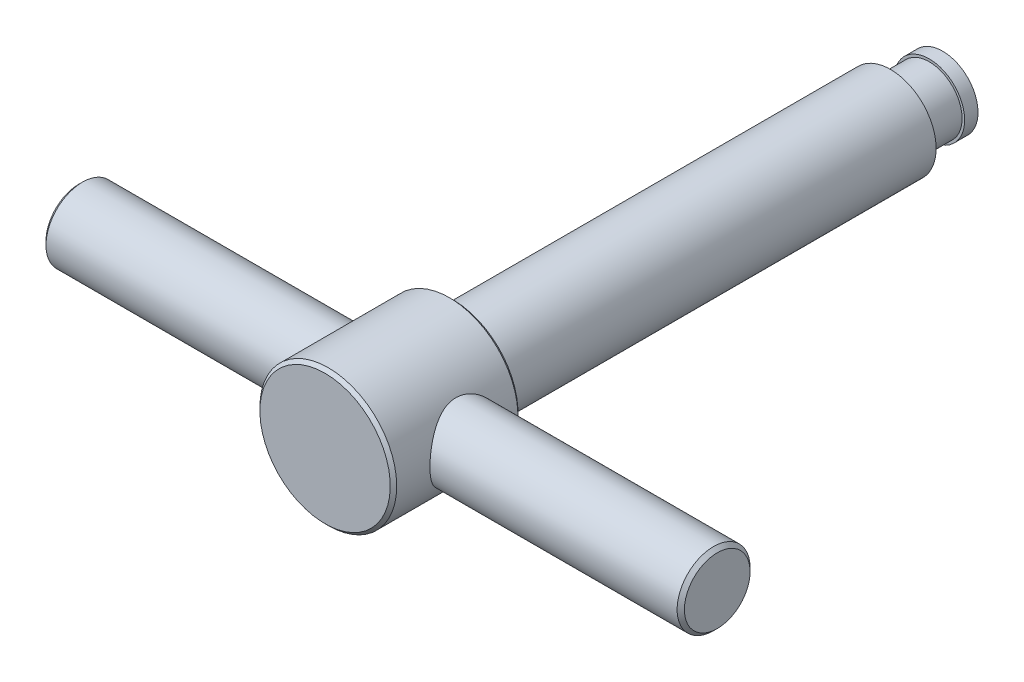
ISO-10303-21;
HEADER;
FILE_DESCRIPTION(('STEP AP214'),'2;1');
FILE_NAME('part.step','',(''),(''),'','','');
FILE_SCHEMA(('AUTOMOTIVE_DESIGN { 1 0 10303 214 1 1 1 1 }'));
ENDSEC;
DATA;
#1=APPLICATION_CONTEXT('core data for automotive mechanical design processes');
#2=APPLICATION_PROTOCOL_DEFINITION('international standard','automotive_design',2000,#1);
#3=PRODUCT_CONTEXT('',#1,'mechanical');
#4=PRODUCT('Part','Part','',(#3));
#5=PRODUCT_RELATED_PRODUCT_CATEGORY('part','',(#4));
#6=PRODUCT_DEFINITION_FORMATION('','',#4);
#7=PRODUCT_DEFINITION_CONTEXT('part definition',#1,'design');
#8=PRODUCT_DEFINITION('design','',#6,#7);
#9=PRODUCT_DEFINITION_SHAPE('','',#8);
#10=(LENGTH_UNIT() NAMED_UNIT(*) SI_UNIT(.MILLI.,.METRE.));
#11=(NAMED_UNIT(*) PLANE_ANGLE_UNIT() SI_UNIT($,.RADIAN.));
#12=(NAMED_UNIT(*) SI_UNIT($,.STERADIAN.) SOLID_ANGLE_UNIT());
#13=UNCERTAINTY_MEASURE_WITH_UNIT(LENGTH_MEASURE(1.E-05),#10,'distance_accuracy_value','');
#14=(GEOMETRIC_REPRESENTATION_CONTEXT(3) GLOBAL_UNCERTAINTY_ASSIGNED_CONTEXT((#13)) GLOBAL_UNIT_ASSIGNED_CONTEXT((#10,
#11,#12)) REPRESENTATION_CONTEXT('',''));
#15=CARTESIAN_POINT('',(0.,0.,0.));
#16=DIRECTION('',(0.,0.,1.));
#17=DIRECTION('',(1.,0.,0.));
#18=AXIS2_PLACEMENT_3D('',#15,#16,#17);
#19=CARTESIAN_POINT('',(70.,0.,129.2));
#20=DIRECTION('',(-1.,0.,0.));
#21=DIRECTION('',(0.,-1.,0.));
#22=AXIS2_PLACEMENT_3D('',#19,#20,#21);
#23=PLANE('',#22);
#24=CARTESIAN_POINT('',(70.,0.,122.));
#25=DIRECTION('',(-1.,0.,0.));
#26=DIRECTION('',(0.,-1.,0.));
#27=AXIS2_PLACEMENT_3D('',#24,#25,#26);
#28=CIRCLE('',#27,7.2);
#29=CARTESIAN_POINT('',(70.,-7.2,122.));
#30=VERTEX_POINT('',#29);
#31=EDGE_CURVE('E15',#30,#30,#28,.T.);
#32=ORIENTED_EDGE('',*,*,#31,.F.);
#33=EDGE_LOOP('',(#32));
#34=FACE_BOUND('',#33,.T.);
#35=ADVANCED_FACE('F12',(#34),#23,.F.);
#36=CARTESIAN_POINT('',(-70.,0.,122.));
#37=DIRECTION('',(1.,0.,0.));
#38=DIRECTION('',(0.,1.,0.));
#39=AXIS2_PLACEMENT_3D('',#36,#37,#38);
#40=PLANE('',#39);
#41=CARTESIAN_POINT('',(-70.,0.,122.));
#42=DIRECTION('',(1.,0.,0.));
#43=DIRECTION('',(0.,1.,0.));
#44=AXIS2_PLACEMENT_3D('',#41,#42,#43);
#45=CIRCLE('',#44,7.2);
#46=CARTESIAN_POINT('',(-70.,7.2,122.));
#47=VERTEX_POINT('',#46);
#48=EDGE_CURVE('E133',#47,#47,#45,.T.);
#49=ORIENTED_EDGE('',*,*,#48,.F.);
#50=EDGE_LOOP('',(#49));
#51=FACE_BOUND('',#50,.T.);
#52=ADVANCED_FACE('F171',(#51),#40,.F.);
#53=CARTESIAN_POINT('',(0.,0.,13.));
#54=DIRECTION('',(-1.,0.,0.));
#55=DIRECTION('',(0.,1.,0.));
#56=AXIS2_PLACEMENT_3D('',#53,#54,#55);
#57=SPHERICAL_SURFACE('',#56,13.);
#58=CARTESIAN_POINT('',(0.,0.,2.56268712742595));
#59=DIRECTION('',(0.,0.,1.));
#60=DIRECTION('',(0.,-1.,0.));
#61=AXIS2_PLACEMENT_3D('',#58,#59,#60);
#62=CIRCLE('',#61,7.75);
#63=CARTESIAN_POINT('',(0.,-7.75,2.56268712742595));
#64=VERTEX_POINT('',#63);
#65=EDGE_CURVE('E126',#64,#64,#62,.T.);
#66=ORIENTED_EDGE('',*,*,#65,.F.);
#67=EDGE_LOOP('',(#66));
#68=FACE_BOUND('',#67,.T.);
#69=ADVANCED_FACE('F168',(#68),#57,.T.);
#70=CARTESIAN_POINT('',(69.2,0.,122.));
#71=DIRECTION('',(-1.,0.,0.));
#72=DIRECTION('',(0.,-1.,0.));
#73=AXIS2_PLACEMENT_3D('',#70,#71,#72);
#74=CONICAL_SURFACE('',#73,8.,0.785398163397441);
#75=CARTESIAN_POINT('',(69.2,0.,122.));
#76=DIRECTION('',(-1.,0.,0.));
#77=DIRECTION('',(0.,-1.,0.));
#78=AXIS2_PLACEMENT_3D('',#75,#76,#77);
#79=CIRCLE('',#78,8.);
#80=CARTESIAN_POINT('',(69.2,-8.,122.));
#81=VERTEX_POINT('',#80);
#82=EDGE_CURVE('E124',#81,#81,#79,.T.);
#83=ORIENTED_EDGE('',*,*,#82,.F.);
#84=EDGE_LOOP('',(#83));
#85=FACE_BOUND('',#84,.T.);
#86=ORIENTED_EDGE('',*,*,#31,.T.);
#87=EDGE_LOOP('',(#86));
#88=FACE_BOUND('',#87,.T.);
#89=ADVANCED_FACE('F164',(#85,#88),#74,.T.);
#90=CARTESIAN_POINT('',(0.,0.,138.));
#91=DIRECTION('',(0.,0.,-1.));
#92=DIRECTION('',(0.,1.,0.));
#93=AXIS2_PLACEMENT_3D('',#90,#91,#92);
#94=PLANE('',#93);
#95=CARTESIAN_POINT('',(0.,0.,138.));
#96=DIRECTION('',(0.,0.,-1.));
#97=DIRECTION('',(0.,1.,0.));
#98=AXIS2_PLACEMENT_3D('',#95,#96,#97);
#99=CIRCLE('',#98,14.2928932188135);
#100=CARTESIAN_POINT('',(0.,14.2928932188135,138.));
#101=VERTEX_POINT('',#100);
#102=EDGE_CURVE('E121',#101,#101,#99,.T.);
#103=ORIENTED_EDGE('',*,*,#102,.F.);
#104=EDGE_LOOP('',(#103));
#105=FACE_BOUND('',#104,.T.);
#106=ADVANCED_FACE('F160',(#105),#94,.F.);
#107=CARTESIAN_POINT('',(-69.2,0.,122.));
#108=DIRECTION('',(1.,0.,0.));
#109=DIRECTION('',(0.,1.,0.));
#110=AXIS2_PLACEMENT_3D('',#107,#108,#109);
#111=CONICAL_SURFACE('',#110,8.,0.785398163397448);
#112=ORIENTED_EDGE('',*,*,#48,.T.);
#113=EDGE_LOOP('',(#112));
#114=FACE_BOUND('',#113,.T.);
#115=CARTESIAN_POINT('',(-69.2,0.,122.));
#116=DIRECTION('',(-1.,0.,0.));
#117=DIRECTION('',(0.,-1.,0.));
#118=AXIS2_PLACEMENT_3D('',#115,#116,#117);
#119=CIRCLE('',#118,8.);
#120=CARTESIAN_POINT('',(-69.2,-8.,122.));
#121=VERTEX_POINT('',#120);
#122=EDGE_CURVE('E117',#121,#121,#119,.F.);
#123=ORIENTED_EDGE('',*,*,#122,.F.);
#124=EDGE_LOOP('',(#123));
#125=FACE_BOUND('',#124,.T.);
#126=ADVANCED_FACE('F154',(#114,#125),#111,.T.);
#127=CARTESIAN_POINT('',(0.,0.,0.));
#128=DIRECTION('',(0.,0.,1.));
#129=DIRECTION('',(0.,-1.,0.));
#130=AXIS2_PLACEMENT_3D('',#127,#128,#129);
#131=CYLINDRICAL_SURFACE('',#130,7.75);
#132=CARTESIAN_POINT('',(0.,0.,5.5));
#133=DIRECTION('',(0.,0.,1.));
#134=DIRECTION('',(0.,-1.,0.));
#135=AXIS2_PLACEMENT_3D('',#132,#133,#134);
#136=CIRCLE('',#135,7.75);
#137=CARTESIAN_POINT('',(0.,-7.75,5.5));
#138=VERTEX_POINT('',#137);
#139=EDGE_CURVE('E120',#138,#138,#136,.F.);
#140=ORIENTED_EDGE('',*,*,#139,.T.);
#141=EDGE_LOOP('',(#140));
#142=FACE_BOUND('',#141,.T.);
#143=ORIENTED_EDGE('',*,*,#65,.T.);
#144=EDGE_LOOP('',(#143));
#145=FACE_BOUND('',#144,.T.);
#146=ADVANCED_FACE('F147',(#142,#145),#131,.T.);
#147=CARTESIAN_POINT('',(70.,0.,122.));
#148=DIRECTION('',(-1.,0.,0.));
#149=DIRECTION('',(0.,-1.,0.));
#150=AXIS2_PLACEMENT_3D('',#147,#148,#149);
#151=CYLINDRICAL_SURFACE('',#150,8.);
#152=CARTESIAN_POINT('',(12.6892944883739,7.99886275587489,121.86511259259));
#153=CARTESIAN_POINT('',(12.6915005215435,7.99536276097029,121.657535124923));
#154=CARTESIAN_POINT('',(12.698815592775,7.98377231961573,121.4501531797));
#155=CARTESIAN_POINT('',(12.7233681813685,7.94458516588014,121.037422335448));
#156=CARTESIAN_POINT('',(12.7406097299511,7.91698195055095,120.832074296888));
#157=CARTESIAN_POINT('',(12.7843716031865,7.84611824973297,120.424812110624));
#158=CARTESIAN_POINT('',(12.8109052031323,7.8028353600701,120.22290331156));
#159=CARTESIAN_POINT('',(12.8722778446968,7.7011676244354,119.824136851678));
#160=CARTESIAN_POINT('',(12.9071206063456,7.64277601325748,119.627281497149));
#161=CARTESIAN_POINT('',(12.983665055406,7.51199941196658,119.241170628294));
#162=CARTESIAN_POINT('',(13.0253198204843,7.43970959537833,119.051873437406));
#163=CARTESIAN_POINT('',(13.1143932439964,7.28154717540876,118.680383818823));
#164=CARTESIAN_POINT('',(13.1618139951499,7.19566963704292,118.498194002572));
#165=CARTESIAN_POINT('',(13.2610944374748,7.01101575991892,118.141772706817));
#166=CARTESIAN_POINT('',(13.3129533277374,6.9122417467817,117.967539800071));
#167=CARTESIAN_POINT('',(13.4197993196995,6.70245383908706,117.627695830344));
#168=CARTESIAN_POINT('',(13.4747865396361,6.59143948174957,117.462085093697));
#169=CARTESIAN_POINT('',(13.6534578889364,6.21800819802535,116.947595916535));
#170=CARTESIAN_POINT('',(13.7808278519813,5.9329855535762,116.615815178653));
#171=CARTESIAN_POINT('',(13.9689823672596,5.46769874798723,116.156026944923));
#172=CARTESIAN_POINT('',(14.0312550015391,5.30619866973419,116.008998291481));
#173=CARTESIAN_POINT('',(14.1534426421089,4.97109760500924,115.728164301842));
#174=CARTESIAN_POINT('',(14.2133572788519,4.79749473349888,115.59436103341));
#175=CARTESIAN_POINT('',(14.3333751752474,4.42661700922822,115.33215451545));
#176=CARTESIAN_POINT('',(14.3932045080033,4.22853538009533,115.204765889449));
#177=CARTESIAN_POINT('',(14.5067990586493,3.82067538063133,114.96735624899));
#178=CARTESIAN_POINT('',(14.5605669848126,3.61090229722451,114.857327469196));
#179=CARTESIAN_POINT('',(14.6604907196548,3.18098894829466,114.655774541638));
#180=CARTESIAN_POINT('',(14.7066493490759,2.96085256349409,114.564243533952));
#181=CARTESIAN_POINT('',(14.7899668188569,2.51177337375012,114.400785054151));
#182=CARTESIAN_POINT('',(14.8271268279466,2.2828317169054,114.328855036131));
#183=CARTESIAN_POINT('',(14.8884993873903,1.83808610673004,114.210923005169));
#184=CARTESIAN_POINT('',(14.9135510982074,1.6228476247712,114.163222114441));
#185=CARTESIAN_POINT('',(14.9544481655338,1.1883122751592,114.08567062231));
#186=CARTESIAN_POINT('',(14.9702940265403,0.969015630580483,114.05581904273));
#187=CARTESIAN_POINT('',(14.9923149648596,0.528336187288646,114.014399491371));
#188=CARTESIAN_POINT('',(14.9984951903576,0.30695456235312,114.002821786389));
#189=CARTESIAN_POINT('',(15.0010180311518,-0.136055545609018,113.998090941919));
#190=CARTESIAN_POINT('',(14.9973612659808,-0.357684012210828,114.004936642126));
#191=CARTESIAN_POINT('',(14.981126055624,-0.778417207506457,114.03543599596));
#192=CARTESIAN_POINT('',(14.9694202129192,-0.977677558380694,114.057446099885));
#193=CARTESIAN_POINT('',(14.9383067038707,-1.37346486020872,114.116242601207));
#194=CARTESIAN_POINT('',(14.9188964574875,-1.56999087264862,114.153033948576));
#195=CARTESIAN_POINT('',(14.8728340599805,-1.95886060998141,114.240966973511));
#196=CARTESIAN_POINT('',(14.8461843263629,-2.15120570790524,114.292103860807));
#197=CARTESIAN_POINT('',(14.7862300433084,-2.53067624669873,114.408223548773));
#198=CARTESIAN_POINT('',(14.7529229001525,-2.71779962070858,114.473211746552));
#199=CARTESIAN_POINT('',(14.6796612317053,-3.08935153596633,114.617830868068));
#200=CARTESIAN_POINT('',(14.6395886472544,-3.27365430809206,114.697725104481));
#201=CARTESIAN_POINT('',(14.5541371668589,-3.63477338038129,114.870586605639));
#202=CARTESIAN_POINT('',(14.5087564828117,-3.81158713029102,114.963558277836));
#203=CARTESIAN_POINT('',(14.366052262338,-4.32949358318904,115.261018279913));
#204=CARTESIAN_POINT('',(14.2621230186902,-4.658263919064,115.484135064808));
#205=CARTESIAN_POINT('',(14.0332510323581,-5.31033875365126,116.000724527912));
#206=CARTESIAN_POINT('',(13.9072489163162,-5.6293476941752,116.29915474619));
#207=CARTESIAN_POINT('',(13.7186181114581,-6.06836546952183,116.782485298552));
#208=CARTESIAN_POINT('',(13.6557521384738,-6.20821998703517,116.9496939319));
#209=CARTESIAN_POINT('',(13.5316987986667,-6.47415011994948,117.295436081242));
#210=CARTESIAN_POINT('',(13.4705117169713,-6.60022340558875,117.473971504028));
#211=CARTESIAN_POINT('',(13.3471818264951,-6.84638984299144,117.854878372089));
#212=CARTESIAN_POINT('',(13.2852906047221,-6.96538902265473,118.058039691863));
#213=CARTESIAN_POINT('',(13.167502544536,-7.18557329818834,118.475350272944));
#214=CARTESIAN_POINT('',(13.1116028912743,-7.28676677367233,118.689494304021));
#215=CARTESIAN_POINT('',(13.0079356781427,-7.47025544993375,119.127440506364));
#216=CARTESIAN_POINT('',(12.9601615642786,-7.55256590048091,119.351234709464));
#217=CARTESIAN_POINT('',(12.8747418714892,-7.6972788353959,119.807047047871));
#218=CARTESIAN_POINT('',(12.8370945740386,-7.75968469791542,120.039063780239));
#219=CARTESIAN_POINT('',(12.7766247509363,-7.8588111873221,120.487742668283));
#220=CARTESIAN_POINT('',(12.7527587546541,-7.89736348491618,120.703859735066));
#221=CARTESIAN_POINT('',(12.715875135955,-7.95661670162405,121.139450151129));
#222=CARTESIAN_POINT('',(12.7028567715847,-7.97731884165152,121.358923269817));
#223=CARTESIAN_POINT('',(12.6882634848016,-8.00050992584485,121.799062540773));
#224=CARTESIAN_POINT('',(12.6866808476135,-8.00301114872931,122.019727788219));
#225=CARTESIAN_POINT('',(12.6950135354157,-7.98978692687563,122.46028233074));
#226=CARTESIAN_POINT('',(12.7049279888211,-7.97406286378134,122.680171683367));
#227=CARTESIAN_POINT('',(12.7338390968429,-7.9277970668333,123.089466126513));
#228=CARTESIAN_POINT('',(12.7515286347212,-7.89938068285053,123.279209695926));
#229=CARTESIAN_POINT('',(12.7947377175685,-7.82920080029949,123.655364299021));
#230=CARTESIAN_POINT('',(12.8202598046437,-7.78743296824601,123.841774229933));
#231=CARTESIAN_POINT('',(12.8783315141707,-7.69101670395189,124.210089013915));
#232=CARTESIAN_POINT('',(12.910880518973,-7.63636940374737,124.39199426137));
#233=CARTESIAN_POINT('',(12.982063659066,-7.51471774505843,124.750433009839));
#234=CARTESIAN_POINT('',(13.0207002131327,-7.44770847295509,124.926964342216));
#235=CARTESIAN_POINT('',(13.1488722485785,-7.22069987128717,125.466897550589));
#236=CARTESIAN_POINT('',(13.2472287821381,-7.04015992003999,125.819794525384));
#237=CARTESIAN_POINT('',(13.4565981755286,-6.63118330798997,126.492508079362));
#238=CARTESIAN_POINT('',(13.5676179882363,-6.4027202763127,126.812306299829));
#239=CARTESIAN_POINT('',(13.7446246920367,-6.00916810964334,127.285855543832));
#240=CARTESIAN_POINT('',(13.8096255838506,-5.85860208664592,127.452258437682));
#241=CARTESIAN_POINT('',(13.9389400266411,-5.54390231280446,127.77195170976));
#242=CARTESIAN_POINT('',(14.0032537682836,-5.37977244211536,127.925245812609));
#243=CARTESIAN_POINT('',(14.1296197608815,-5.0385492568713,128.218006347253));
#244=CARTESIAN_POINT('',(14.1916701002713,-4.86144534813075,128.357461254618));
#245=CARTESIAN_POINT('',(14.3118643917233,-4.49529134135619,128.6214246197));
#246=CARTESIAN_POINT('',(14.370010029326,-4.306246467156,128.745939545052));
#247=CARTESIAN_POINT('',(14.4826332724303,-3.91111396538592,128.98268149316));
#248=CARTESIAN_POINT('',(14.5369434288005,-3.70468126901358,129.094413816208));
#249=CARTESIAN_POINT('',(14.638318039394,-3.28131316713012,129.29988650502));
#250=CARTESIAN_POINT('',(14.6853822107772,-3.06437735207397,129.393626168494));
#251=CARTESIAN_POINT('',(14.7708257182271,-2.62172979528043,129.561914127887));
#252=CARTESIAN_POINT('',(14.8092123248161,-2.39602558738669,129.636478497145));
#253=CARTESIAN_POINT('',(14.8761439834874,-1.93752040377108,129.765481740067));
#254=CARTESIAN_POINT('',(14.9046904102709,-1.70472042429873,129.819923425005));
#255=CARTESIAN_POINT('',(14.9486186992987,-1.25847496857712,129.903310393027));
#256=CARTESIAN_POINT('',(14.9650560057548,-1.04551498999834,129.934308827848));
#257=CARTESIAN_POINT('',(14.9888266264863,-0.617288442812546,129.97905300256));
#258=CARTESIAN_POINT('',(14.9961605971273,-0.402022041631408,129.992799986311));
#259=CARTESIAN_POINT('',(15.0015197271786,0.0289601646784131,130.002850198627));
#260=CARTESIAN_POINT('',(14.9995479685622,0.244675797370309,129.999159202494));
#261=CARTESIAN_POINT('',(14.986357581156,0.674817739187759,129.974398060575));
#262=CARTESIAN_POINT('',(14.9751392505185,0.889244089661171,129.953328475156));
#263=CARTESIAN_POINT('',(14.9449461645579,1.29907532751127,129.896325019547));
#264=CARTESIAN_POINT('',(14.9266159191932,1.49470112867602,129.861623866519));
#265=CARTESIAN_POINT('',(14.8827292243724,1.88212313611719,129.777975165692));
#266=CARTESIAN_POINT('',(14.8571703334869,2.07391802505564,129.729022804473));
#267=CARTESIAN_POINT('',(14.7994088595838,2.45237301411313,129.617399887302));
#268=CARTESIAN_POINT('',(14.7672082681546,2.6390346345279,129.554733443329));
#269=CARTESIAN_POINT('',(14.6968369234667,3.00632106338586,129.416237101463));
#270=CARTESIAN_POINT('',(14.6586638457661,3.18694348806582,129.340402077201));
#271=CARTESIAN_POINT('',(14.5753142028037,3.54912314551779,129.172539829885));
#272=CARTESIAN_POINT('',(14.5299005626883,3.73036002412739,129.079939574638));
#273=CARTESIAN_POINT('',(14.4343837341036,4.08438470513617,128.881785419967));
#274=CARTESIAN_POINT('',(14.3842789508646,4.25716960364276,128.776227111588));
#275=CARTESIAN_POINT('',(14.2804213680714,4.59353407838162,128.552878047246));
#276=CARTESIAN_POINT('',(14.2266678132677,4.75711173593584,128.435084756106));
#277=CARTESIAN_POINT('',(14.1166098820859,5.07439931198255,128.187965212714));
#278=CARTESIAN_POINT('',(14.0603053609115,5.22810866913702,128.058638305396));
#279=CARTESIAN_POINT('',(13.9399234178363,5.54164068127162,127.774070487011));
#280=CARTESIAN_POINT('',(13.8756786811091,5.70023771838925,127.617547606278));
#281=CARTESIAN_POINT('',(13.7470505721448,6.00381408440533,127.291859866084));
#282=CARTESIAN_POINT('',(13.6826671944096,6.14879286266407,127.122694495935));
#283=CARTESIAN_POINT('',(13.5553846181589,6.42453340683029,126.772327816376));
#284=CARTESIAN_POINT('',(13.4924869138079,6.55528130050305,126.591115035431));
#285=CARTESIAN_POINT('',(13.369992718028,6.80163406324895,126.217563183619));
#286=CARTESIAN_POINT('',(13.3103967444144,6.91723656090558,126.025222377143));
#287=CARTESIAN_POINT('',(13.1937787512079,7.13725424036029,125.621436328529));
#288=CARTESIAN_POINT('',(13.1369921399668,7.24093489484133,125.409521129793));
#289=CARTESIAN_POINT('',(13.0311666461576,7.42969787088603,124.975816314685));
#290=CARTESIAN_POINT('',(12.9821236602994,7.5147900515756,124.754032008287));
#291=CARTESIAN_POINT('',(12.893911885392,7.66515673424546,124.302569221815));
#292=CARTESIAN_POINT('',(12.85471792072,7.73048185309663,124.072912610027));
#293=CARTESIAN_POINT('',(12.787887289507,7.84054245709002,123.607196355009));
#294=CARTESIAN_POINT('',(12.7602428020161,7.88529187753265,123.371141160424));
#295=CARTESIAN_POINT('',(12.7204492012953,7.94930196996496,122.923741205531));
#296=CARTESIAN_POINT('',(12.7068270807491,7.97099628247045,122.712872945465));
#297=CARTESIAN_POINT('',(12.6901221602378,7.99756562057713,122.289639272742));
#298=CARTESIAN_POINT('',(12.6870397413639,8.00244003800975,122.077273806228));
#299=CARTESIAN_POINT('',(12.6892944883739,7.99886275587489,121.86511259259));
#300=B_SPLINE_CURVE_WITH_KNOTS('',3,(#152,#153,#154,#155,#156,#157,#158,#159,#160,#161,#162,
#163,#164,#165,#166,#167,#168,#169,#170,#171,#172,#173,#174,#175,#176,#177,#178,#179,#180,#181,
#182,#183,#184,#185,#186,#187,#188,#189,#190,#191,#192,#193,#194,#195,#196,#197,#198,#199,#200,
#201,#202,#203,#204,#205,#206,#207,#208,#209,#210,#211,#212,#213,#214,#215,#216,#217,#218,#219,
#220,#221,#222,#223,#224,#225,#226,#227,#228,#229,#230,#231,#232,#233,#234,#235,#236,#237,#238,
#239,#240,#241,#242,#243,#244,#245,#246,#247,#248,#249,#250,#251,#252,#253,#254,#255,#256,#257,
#258,#259,#260,#261,#262,#263,#264,#265,#266,#267,#268,#269,#270,#271,#272,#273,#274,#275,#276,
#277,#278,#279,#280,#281,#282,#283,#284,#285,#286,#287,#288,#289,#290,#291,#292,#293,#294,#295,
#296,#297,#298,#299),.UNSPECIFIED.,.T.,.F.,(4,2,2,2,2,2,2,2,2,2,2,2,2,2,2,2,2,2,2,2,2,2,2,2,2,2,
2,2,2,2,2,2,2,2,2,2,2,2,2,2,2,2,2,2,2,2,2,2,2,2,2,2,2,2,2,2,2,2,2,2,2,2,2,2,2,2,2,2,2,2,2,2,2,
4),(0.,0.622631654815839,1.24551634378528,1.86929458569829,2.49335262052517,3.11328030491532,
3.73343366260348,4.35347534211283,4.97354047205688,6.33343330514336,7.0142280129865,
7.69512899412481,8.42315420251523,9.15085282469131,9.87828108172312,10.6056148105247,
11.270340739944,11.9350302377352,12.599365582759,13.2636590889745,13.8653947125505,
14.4673320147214,15.0690685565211,15.6710399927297,16.2848738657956,16.8989151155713,
18.1263080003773,19.484165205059,20.1642035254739,20.844356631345,21.5737574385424,
22.3028140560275,23.0312798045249,23.7596218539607,24.4211187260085,25.0825703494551,
25.743575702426,26.4045309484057,26.9819001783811,27.559456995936,28.1369630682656,
28.7146991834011,29.9349233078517,31.1558206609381,31.8560597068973,32.5560991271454,
33.2567166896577,33.9570298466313,34.6788463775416,35.4006910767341,36.1219287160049,
36.8430655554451,37.4896930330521,38.1362738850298,38.7826406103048,39.4289864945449,
40.0268786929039,40.6249730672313,41.2228883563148,41.8210369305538,42.4459714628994,
43.0711192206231,43.696396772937,44.3217098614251,45.0166630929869,45.7116444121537,
46.4072972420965,47.1030588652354,47.8300331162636,48.5566208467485,49.2813319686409,
50.0055515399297,50.6419091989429,51.2782898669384),.UNSPECIFIED.);
#301=CARTESIAN_POINT('',(12.6892944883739,7.99886275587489,121.86511259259));
#302=VERTEX_POINT('',#301);
#303=EDGE_CURVE('E46',#302,#302,#300,.T.);
#304=ORIENTED_EDGE('',*,*,#303,.F.);
#305=EDGE_LOOP('',(#304));
#306=FACE_BOUND('',#305,.T.);
#307=ORIENTED_EDGE('',*,*,#82,.T.);
#308=EDGE_LOOP('',(#307));
#309=FACE_BOUND('',#308,.T.);
#310=ADVANCED_FACE('F145',(#306,#309),#151,.T.);
#311=CARTESIAN_POINT('',(0.,0.,137.292893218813));
#312=DIRECTION('',(0.,0.,-1.));
#313=DIRECTION('',(0.,1.,0.));
#314=AXIS2_PLACEMENT_3D('',#311,#312,#313);
#315=CONICAL_SURFACE('',#314,15.0000000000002,0.785398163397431);
#316=ORIENTED_EDGE('',*,*,#102,.T.);
#317=EDGE_LOOP('',(#316));
#318=FACE_BOUND('',#317,.T.);
#319=CARTESIAN_POINT('',(0.,0.,137.292893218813));
#320=DIRECTION('',(0.,0.,1.));
#321=DIRECTION('',(0.,-1.,0.));
#322=AXIS2_PLACEMENT_3D('',#319,#320,#321);
#323=CIRCLE('',#322,15.);
#324=CARTESIAN_POINT('',(0.,-15.,137.292893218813));
#325=VERTEX_POINT('',#324);
#326=EDGE_CURVE('E45',#325,#325,#323,.F.);
#327=ORIENTED_EDGE('',*,*,#326,.F.);
#328=EDGE_LOOP('',(#327));
#329=FACE_BOUND('',#328,.T.);
#330=ADVANCED_FACE('F72',(#318,#329),#315,.T.);
#331=CARTESIAN_POINT('',(70.,0.,122.));
#332=DIRECTION('',(-1.,0.,0.));
#333=DIRECTION('',(0.,-1.,0.));
#334=AXIS2_PLACEMENT_3D('',#331,#332,#333);
#335=CYLINDRICAL_SURFACE('',#334,8.);
#336=ORIENTED_EDGE('',*,*,#122,.T.);
#337=EDGE_LOOP('',(#336));
#338=FACE_BOUND('',#337,.T.);
#339=CARTESIAN_POINT('',(-12.6892944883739,7.99886275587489,122.13488740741));
#340=CARTESIAN_POINT('',(-12.6915005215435,7.99536276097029,122.342464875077));
#341=CARTESIAN_POINT('',(-12.698815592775,7.98377231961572,122.5498468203));
#342=CARTESIAN_POINT('',(-12.7233681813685,7.94458516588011,122.962577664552));
#343=CARTESIAN_POINT('',(-12.7406097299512,7.91698195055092,123.167925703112));
#344=CARTESIAN_POINT('',(-12.7843716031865,7.84611824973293,123.575187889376));
#345=CARTESIAN_POINT('',(-12.8109052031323,7.80283536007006,123.77709668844));
#346=CARTESIAN_POINT('',(-12.8722778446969,7.70116762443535,124.175863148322));
#347=CARTESIAN_POINT('',(-12.9071206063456,7.64277601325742,124.372718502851));
#348=CARTESIAN_POINT('',(-12.983665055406,7.51199941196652,124.758829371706));
#349=CARTESIAN_POINT('',(-13.0253198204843,7.43970959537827,124.948126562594));
#350=CARTESIAN_POINT('',(-13.1143932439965,7.2815471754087,125.319616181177));
#351=CARTESIAN_POINT('',(-13.1618139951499,7.19566963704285,125.501805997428));
#352=CARTESIAN_POINT('',(-13.2610944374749,7.01101575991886,125.858227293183));
#353=CARTESIAN_POINT('',(-13.3129533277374,6.91224174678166,126.032460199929));
#354=CARTESIAN_POINT('',(-13.4197993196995,6.70245383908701,126.372304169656));
#355=CARTESIAN_POINT('',(-13.4747865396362,6.59143948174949,126.537914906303));
#356=CARTESIAN_POINT('',(-13.6534578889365,6.21800819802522,127.052404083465));
#357=CARTESIAN_POINT('',(-13.7808278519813,5.93298555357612,127.384184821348));
#358=CARTESIAN_POINT('',(-13.9689823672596,5.46769874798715,127.843973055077));
#359=CARTESIAN_POINT('',(-14.0312550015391,5.3061986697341,127.991001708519));
#360=CARTESIAN_POINT('',(-14.153442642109,4.9710976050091,128.271835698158));
#361=CARTESIAN_POINT('',(-14.2133572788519,4.7974947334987,128.40563896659));
#362=CARTESIAN_POINT('',(-14.3333751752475,4.42661700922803,128.66784548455));
#363=CARTESIAN_POINT('',(-14.3932045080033,4.22853538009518,128.795234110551));
#364=CARTESIAN_POINT('',(-14.5067990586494,3.82067538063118,129.03264375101));
#365=CARTESIAN_POINT('',(-14.5605669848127,3.61090229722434,129.142672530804));
#366=CARTESIAN_POINT('',(-14.6604907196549,3.18098894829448,129.344225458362));
#367=CARTESIAN_POINT('',(-14.706649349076,2.96085256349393,129.435756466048));
#368=CARTESIAN_POINT('',(-14.789966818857,2.51177337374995,129.599214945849));
#369=CARTESIAN_POINT('',(-14.8271268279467,2.28283171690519,129.671144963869));
#370=CARTESIAN_POINT('',(-14.8884993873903,1.83808610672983,129.789076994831));
#371=CARTESIAN_POINT('',(-14.9135510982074,1.62284762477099,129.836777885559));
#372=CARTESIAN_POINT('',(-14.9544481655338,1.188312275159,129.91432937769));
#373=CARTESIAN_POINT('',(-14.9702940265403,0.969015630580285,129.94418095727));
#374=CARTESIAN_POINT('',(-14.9923149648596,0.52833618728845,129.985600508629));
#375=CARTESIAN_POINT('',(-14.9984951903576,0.306954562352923,129.997178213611));
#376=CARTESIAN_POINT('',(-15.0010180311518,-0.136055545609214,130.001909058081));
#377=CARTESIAN_POINT('',(-14.9973612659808,-0.357684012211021,129.995063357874));
#378=CARTESIAN_POINT('',(-14.981126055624,-0.778417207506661,129.96456400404));
#379=CARTESIAN_POINT('',(-14.9694202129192,-0.977677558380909,129.942553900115));
#380=CARTESIAN_POINT('',(-14.9383067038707,-1.37346486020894,129.883757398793));
#381=CARTESIAN_POINT('',(-14.9188964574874,-1.56999087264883,129.846966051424));
#382=CARTESIAN_POINT('',(-14.8728340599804,-1.95886060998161,129.759033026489));
#383=CARTESIAN_POINT('',(-14.8461843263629,-2.15120570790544,129.707896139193));
#384=CARTESIAN_POINT('',(-14.7862300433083,-2.53067624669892,129.591776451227));
#385=CARTESIAN_POINT('',(-14.7529229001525,-2.71779962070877,129.526788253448));
#386=CARTESIAN_POINT('',(-14.6796612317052,-3.08935153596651,129.382169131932));
#387=CARTESIAN_POINT('',(-14.6395886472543,-3.27365430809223,129.302274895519));
#388=CARTESIAN_POINT('',(-14.5541371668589,-3.63477338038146,129.129413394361));
#389=CARTESIAN_POINT('',(-14.5087564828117,-3.8115871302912,129.036441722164));
#390=CARTESIAN_POINT('',(-14.366052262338,-4.32949358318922,128.738981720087));
#391=CARTESIAN_POINT('',(-14.2621230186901,-4.65826391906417,128.515864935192));
#392=CARTESIAN_POINT('',(-14.0332510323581,-5.31033875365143,127.999275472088));
#393=CARTESIAN_POINT('',(-13.9072489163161,-5.62934769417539,127.70084525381));
#394=CARTESIAN_POINT('',(-13.718618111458,-6.06836546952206,127.217514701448));
#395=CARTESIAN_POINT('',(-13.6557521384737,-6.20821998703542,127.0503060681));
#396=CARTESIAN_POINT('',(-13.5316987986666,-6.47415011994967,126.704563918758));
#397=CARTESIAN_POINT('',(-13.4705117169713,-6.60022340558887,126.526028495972));
#398=CARTESIAN_POINT('',(-13.3471818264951,-6.84638984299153,126.14512162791));
#399=CARTESIAN_POINT('',(-13.285290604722,-6.96538902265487,125.941960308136));
#400=CARTESIAN_POINT('',(-13.1675025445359,-7.1855732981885,125.524649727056));
#401=CARTESIAN_POINT('',(-13.1116028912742,-7.28676677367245,125.310505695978));
#402=CARTESIAN_POINT('',(-13.0079356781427,-7.47025544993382,124.872559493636));
#403=CARTESIAN_POINT('',(-12.9601615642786,-7.55256590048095,124.648765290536));
#404=CARTESIAN_POINT('',(-12.8747418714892,-7.69727883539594,124.192952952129));
#405=CARTESIAN_POINT('',(-12.8370945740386,-7.75968469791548,123.960936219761));
#406=CARTESIAN_POINT('',(-12.7766247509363,-7.85881118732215,123.512257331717));
#407=CARTESIAN_POINT('',(-12.7527587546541,-7.8973634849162,123.296140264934));
#408=CARTESIAN_POINT('',(-12.715875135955,-7.95661670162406,122.86054984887));
#409=CARTESIAN_POINT('',(-12.7028567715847,-7.97731884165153,122.641076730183));
#410=CARTESIAN_POINT('',(-12.6882634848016,-8.00050992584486,122.200937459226));
#411=CARTESIAN_POINT('',(-12.6866808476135,-8.00301114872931,121.980272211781));
#412=CARTESIAN_POINT('',(-12.6950135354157,-7.98978692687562,121.53971766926));
#413=CARTESIAN_POINT('',(-12.7049279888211,-7.97406286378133,121.319828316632));
#414=CARTESIAN_POINT('',(-12.7338390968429,-7.92779706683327,120.910533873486));
#415=CARTESIAN_POINT('',(-12.7515286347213,-7.89938068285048,120.720790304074));
#416=CARTESIAN_POINT('',(-12.7947377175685,-7.82920080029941,120.344635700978));
#417=CARTESIAN_POINT('',(-12.8202598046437,-7.78743296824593,120.158225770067));
#418=CARTESIAN_POINT('',(-12.8783315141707,-7.69101670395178,119.789910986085));
#419=CARTESIAN_POINT('',(-12.9108805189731,-7.63636940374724,119.608005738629));
#420=CARTESIAN_POINT('',(-12.982063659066,-7.51471774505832,119.24956699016));
#421=CARTESIAN_POINT('',(-13.0207002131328,-7.44770847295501,119.073035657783));
#422=CARTESIAN_POINT('',(-13.1488722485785,-7.22069987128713,118.533102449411));
#423=CARTESIAN_POINT('',(-13.2472287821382,-7.04015992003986,118.180205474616));
#424=CARTESIAN_POINT('',(-13.4565981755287,-6.63118330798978,117.507491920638));
#425=CARTESIAN_POINT('',(-13.5676179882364,-6.40272027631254,117.187693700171));
#426=CARTESIAN_POINT('',(-13.7446246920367,-6.00916810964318,116.714144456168));
#427=CARTESIAN_POINT('',(-13.8096255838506,-5.85860208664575,116.547741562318));
#428=CARTESIAN_POINT('',(-13.9389400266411,-5.54390231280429,116.22804829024));
#429=CARTESIAN_POINT('',(-14.0032537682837,-5.37977244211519,116.07475418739));
#430=CARTESIAN_POINT('',(-14.1296197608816,-5.03854925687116,115.781993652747));
#431=CARTESIAN_POINT('',(-14.1916701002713,-4.86144534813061,115.642538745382));
#432=CARTESIAN_POINT('',(-14.3118643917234,-4.49529134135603,115.378575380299));
#433=CARTESIAN_POINT('',(-14.3700100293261,-4.3062464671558,115.254060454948));
#434=CARTESIAN_POINT('',(-14.4826332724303,-3.91111396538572,115.01731850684));
#435=CARTESIAN_POINT('',(-14.5369434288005,-3.70468126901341,114.905586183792));
#436=CARTESIAN_POINT('',(-14.638318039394,-3.28131316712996,114.70011349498));
#437=CARTESIAN_POINT('',(-14.6853822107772,-3.06437735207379,114.606373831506));
#438=CARTESIAN_POINT('',(-14.7708257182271,-2.62172979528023,114.438085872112));
#439=CARTESIAN_POINT('',(-14.8092123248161,-2.3960255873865,114.363521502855));
#440=CARTESIAN_POINT('',(-14.8761439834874,-1.93752040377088,114.234518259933));
#441=CARTESIAN_POINT('',(-14.9046904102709,-1.70472042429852,114.180076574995));
#442=CARTESIAN_POINT('',(-14.9486186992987,-1.2584749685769,114.096689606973));
#443=CARTESIAN_POINT('',(-14.9650560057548,-1.04551498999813,114.065691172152));
#444=CARTESIAN_POINT('',(-14.9888266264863,-0.617288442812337,114.02094699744));
#445=CARTESIAN_POINT('',(-14.9961605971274,-0.4020220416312,114.007200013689));
#446=CARTESIAN_POINT('',(-15.0015197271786,0.0289601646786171,113.997149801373));
#447=CARTESIAN_POINT('',(-14.9995479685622,0.244675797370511,114.000840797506));
#448=CARTESIAN_POINT('',(-14.986357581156,0.674817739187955,114.025601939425));
#449=CARTESIAN_POINT('',(-14.9751392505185,0.889244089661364,114.046671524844));
#450=CARTESIAN_POINT('',(-14.9449461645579,1.29907532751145,114.103674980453));
#451=CARTESIAN_POINT('',(-14.9266159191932,1.49470112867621,114.138376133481));
#452=CARTESIAN_POINT('',(-14.8827292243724,1.88212313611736,114.222024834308));
#453=CARTESIAN_POINT('',(-14.8571703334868,2.07391802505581,114.270977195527));
#454=CARTESIAN_POINT('',(-14.7994088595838,2.45237301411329,114.382600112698));
#455=CARTESIAN_POINT('',(-14.7672082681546,2.63903463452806,114.445266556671));
#456=CARTESIAN_POINT('',(-14.6968369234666,3.00632106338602,114.583762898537));
#457=CARTESIAN_POINT('',(-14.6586638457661,3.186943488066,114.659597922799));
#458=CARTESIAN_POINT('',(-14.5753142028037,3.54912314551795,114.827460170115));
#459=CARTESIAN_POINT('',(-14.5299005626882,3.73036002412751,114.920060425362));
#460=CARTESIAN_POINT('',(-14.4343837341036,4.08438470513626,115.118214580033));
#461=CARTESIAN_POINT('',(-14.3842789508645,4.25716960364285,115.223772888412));
#462=CARTESIAN_POINT('',(-14.2804213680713,4.59353407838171,115.447121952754));
#463=CARTESIAN_POINT('',(-14.2266678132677,4.75711173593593,115.564915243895));
#464=CARTESIAN_POINT('',(-14.1166098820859,5.07439931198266,115.812034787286));
#465=CARTESIAN_POINT('',(-14.0603053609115,5.22810866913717,115.941361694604));
#466=CARTESIAN_POINT('',(-13.9399234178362,5.54164068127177,116.225929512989));
#467=CARTESIAN_POINT('',(-13.875678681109,5.70023771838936,116.382452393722));
#468=CARTESIAN_POINT('',(-13.7470505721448,6.00381408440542,116.708140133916));
#469=CARTESIAN_POINT('',(-13.6826671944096,6.14879286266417,116.877305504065));
#470=CARTESIAN_POINT('',(-13.5553846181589,6.42453340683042,117.227672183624));
#471=CARTESIAN_POINT('',(-13.4924869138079,6.55528130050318,117.408884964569));
#472=CARTESIAN_POINT('',(-13.3699927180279,6.80163406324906,117.782436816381));
#473=CARTESIAN_POINT('',(-13.3103967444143,6.91723656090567,117.974777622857));
#474=CARTESIAN_POINT('',(-13.1937787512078,7.13725424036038,118.378563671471));
#475=CARTESIAN_POINT('',(-13.1369921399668,7.24093489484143,118.590478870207));
#476=CARTESIAN_POINT('',(-13.0311666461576,7.42969787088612,119.024183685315));
#477=CARTESIAN_POINT('',(-12.9821236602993,7.51479005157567,119.245967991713));
#478=CARTESIAN_POINT('',(-12.8939118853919,7.66515673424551,119.697430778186));
#479=CARTESIAN_POINT('',(-12.8547179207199,7.73048185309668,119.927087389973));
#480=CARTESIAN_POINT('',(-12.787887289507,7.84054245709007,120.392803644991));
#481=CARTESIAN_POINT('',(-12.7602428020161,7.88529187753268,120.628858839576));
#482=CARTESIAN_POINT('',(-12.7204492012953,7.94930196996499,121.076258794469));
#483=CARTESIAN_POINT('',(-12.7068270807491,7.97099628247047,121.287127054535));
#484=CARTESIAN_POINT('',(-12.6901221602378,7.99756562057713,121.710360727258));
#485=CARTESIAN_POINT('',(-12.6870397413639,8.00244003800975,121.922726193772));
#486=CARTESIAN_POINT('',(-12.6892944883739,7.99886275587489,122.13488740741));
#487=B_SPLINE_CURVE_WITH_KNOTS('',3,(#339,#340,#341,#342,#343,#344,#345,#346,#347,#348,#349,
#350,#351,#352,#353,#354,#355,#356,#357,#358,#359,#360,#361,#362,#363,#364,#365,#366,#367,#368,
#369,#370,#371,#372,#373,#374,#375,#376,#377,#378,#379,#380,#381,#382,#383,#384,#385,#386,#387,
#388,#389,#390,#391,#392,#393,#394,#395,#396,#397,#398,#399,#400,#401,#402,#403,#404,#405,#406,
#407,#408,#409,#410,#411,#412,#413,#414,#415,#416,#417,#418,#419,#420,#421,#422,#423,#424,#425,
#426,#427,#428,#429,#430,#431,#432,#433,#434,#435,#436,#437,#438,#439,#440,#441,#442,#443,#444,
#445,#446,#447,#448,#449,#450,#451,#452,#453,#454,#455,#456,#457,#458,#459,#460,#461,#462,#463,
#464,#465,#466,#467,#468,#469,#470,#471,#472,#473,#474,#475,#476,#477,#478,#479,#480,#481,#482,
#483,#484,#485,#486),.UNSPECIFIED.,.T.,.F.,(4,2,2,2,2,2,2,2,2,2,2,2,2,2,2,2,2,2,2,2,2,2,2,2,2,2,
2,2,2,2,2,2,2,2,2,2,2,2,2,2,2,2,2,2,2,2,2,2,2,2,2,2,2,2,2,2,2,2,2,2,2,2,2,2,2,2,2,2,2,2,2,2,2,
4),(0.,0.622631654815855,1.24551634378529,1.86929458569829,2.49335262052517,3.11328030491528,
3.7334336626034,4.35347534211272,4.97354047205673,6.33343330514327,7.01422801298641,
7.69512899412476,8.42315420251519,9.15085282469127,9.87828108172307,10.6056148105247,
11.270340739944,11.9350302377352,12.599365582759,13.2636590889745,13.8653947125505,
14.4673320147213,15.069068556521,15.6710399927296,16.2848738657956,16.8989151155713,
18.1263080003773,19.484165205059,20.164203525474,20.8443566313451,21.5737574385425,
22.3028140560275,23.0312798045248,23.7596218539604,24.4211187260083,25.082570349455,
25.743575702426,26.4045309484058,26.9819001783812,27.5594569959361,28.1369630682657,
28.7146991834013,29.9349233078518,31.1558206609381,31.8560597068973,32.5560991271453,
33.2567166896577,33.9570298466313,34.6788463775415,35.400691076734,36.1219287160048,
36.843065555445,37.4896930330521,38.1362738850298,38.7826406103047,39.4289864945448,
40.0268786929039,40.6249730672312,41.2228883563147,41.8210369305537,42.4459714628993,
43.0711192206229,43.6963967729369,44.321709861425,45.0166630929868,45.7116444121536,
46.4072972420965,47.1030588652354,47.8300331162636,48.5566208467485,49.2813319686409,
50.0055515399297,50.6419091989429,51.2782898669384),.UNSPECIFIED.);
#488=CARTESIAN_POINT('',(-12.6892944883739,7.99886275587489,122.13488740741));
#489=VERTEX_POINT('',#488);
#490=EDGE_CURVE('E37',#489,#489,#487,.T.);
#491=ORIENTED_EDGE('',*,*,#490,.F.);
#492=EDGE_LOOP('',(#491));
#493=FACE_BOUND('',#492,.T.);
#494=ADVANCED_FACE('F52',(#338,#493),#335,.T.);
#495=CARTESIAN_POINT('',(7.2,0.,5.5));
#496=DIRECTION('',(0.,0.,-1.));
#497=DIRECTION('',(0.,1.,0.));
#498=AXIS2_PLACEMENT_3D('',#495,#496,#497);
#499=PLANE('',#498);
#500=CARTESIAN_POINT('',(0.,0.,5.5));
#501=DIRECTION('',(0.,0.,1.));
#502=DIRECTION('',(0.,-1.,0.));
#503=AXIS2_PLACEMENT_3D('',#500,#501,#502);
#504=CIRCLE('',#503,7.2);
#505=CARTESIAN_POINT('',(0.,-7.2,5.5));
#506=VERTEX_POINT('',#505);
#507=EDGE_CURVE('E33',#506,#506,#504,.T.);
#508=ORIENTED_EDGE('',*,*,#507,.F.);
#509=EDGE_LOOP('',(#508));
#510=FACE_BOUND('',#509,.T.);
#511=ORIENTED_EDGE('',*,*,#139,.F.);
#512=EDGE_LOOP('',(#511));
#513=FACE_BOUND('',#512,.T.);
#514=ADVANCED_FACE('F61',(#510,#513),#499,.F.);
#515=CARTESIAN_POINT('',(0.,0.,0.));
#516=DIRECTION('',(0.,0.,1.));
#517=DIRECTION('',(0.,-1.,0.));
#518=AXIS2_PLACEMENT_3D('',#515,#516,#517);
#519=CYLINDRICAL_SURFACE('',#518,15.);
#520=ORIENTED_EDGE('',*,*,#490,.T.);
#521=EDGE_LOOP('',(#520));
#522=FACE_BOUND('',#521,.T.);
#523=ORIENTED_EDGE('',*,*,#326,.T.);
#524=EDGE_LOOP('',(#523));
#525=FACE_BOUND('',#524,.T.);
#526=ORIENTED_EDGE('',*,*,#303,.T.);
#527=EDGE_LOOP('',(#526));
#528=FACE_BOUND('',#527,.T.);
#529=CARTESIAN_POINT('',(0.,0.,110.707106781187));
#530=DIRECTION('',(0.,0.,1.));
#531=DIRECTION('',(0.,-1.,0.));
#532=AXIS2_PLACEMENT_3D('',#529,#530,#531);
#533=CIRCLE('',#532,15.);
#534=CARTESIAN_POINT('',(0.,-15.,110.707106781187));
#535=VERTEX_POINT('',#534);
#536=EDGE_CURVE('E36',#535,#535,#533,.F.);
#537=ORIENTED_EDGE('',*,*,#536,.F.);
#538=EDGE_LOOP('',(#537));
#539=FACE_BOUND('',#538,.T.);
#540=ADVANCED_FACE('F56',(#522,#525,#528,#539),#519,.T.);
#541=CARTESIAN_POINT('',(0.,0.,0.));
#542=DIRECTION('',(0.,0.,1.));
#543=DIRECTION('',(0.,-1.,0.));
#544=AXIS2_PLACEMENT_3D('',#541,#542,#543);
#545=CYLINDRICAL_SURFACE('',#544,7.2);
#546=CARTESIAN_POINT('',(0.,0.,12.3834192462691));
#547=DIRECTION('',(0.,0.,1.));
#548=DIRECTION('',(0.,-1.,0.));
#549=AXIS2_PLACEMENT_3D('',#546,#547,#548);
#550=CIRCLE('',#549,7.2);
#551=CARTESIAN_POINT('',(0.,-7.2,12.3834192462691));
#552=VERTEX_POINT('',#551);
#553=EDGE_CURVE('E32',#552,#552,#550,.T.);
#554=ORIENTED_EDGE('',*,*,#553,.F.);
#555=EDGE_LOOP('',(#554));
#556=FACE_BOUND('',#555,.T.);
#557=ORIENTED_EDGE('',*,*,#507,.T.);
#558=EDGE_LOOP('',(#557));
#559=FACE_BOUND('',#558,.T.);
#560=ADVANCED_FACE('F60',(#556,#559),#545,.T.);
#561=CARTESIAN_POINT('',(0.,0.,110.707106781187));
#562=DIRECTION('',(0.,0.,1.));
#563=DIRECTION('',(-1.,0.,0.));
#564=AXIS2_PLACEMENT_3D('',#561,#562,#563);
#565=CONICAL_SURFACE('',#564,15.,0.78539816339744);
#566=ORIENTED_EDGE('',*,*,#536,.T.);
#567=EDGE_LOOP('',(#566));
#568=FACE_BOUND('',#567,.T.);
#569=CARTESIAN_POINT('',(0.,0.,110.));
#570=DIRECTION('',(0.,0.,1.));
#571=DIRECTION('',(-1.,0.,0.));
#572=AXIS2_PLACEMENT_3D('',#569,#570,#571);
#573=CIRCLE('',#572,14.2928932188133);
#574=CARTESIAN_POINT('',(-14.2928932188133,0.,110.));
#575=VERTEX_POINT('',#574);
#576=EDGE_CURVE('E24',#575,#575,#573,.T.);
#577=ORIENTED_EDGE('',*,*,#576,.T.);
#578=EDGE_LOOP('',(#577));
#579=FACE_BOUND('',#578,.T.);
#580=ADVANCED_FACE('F90',(#568,#579),#565,.T.);
#581=CARTESIAN_POINT('',(0.,0.,14.));
#582=DIRECTION('',(0.,0.,1.));
#583=DIRECTION('',(-1.,0.,0.));
#584=AXIS2_PLACEMENT_3D('',#581,#582,#583);
#585=CONICAL_SURFACE('',#584,10.,1.0471975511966);
#586=CARTESIAN_POINT('',(0.,0.,14.));
#587=DIRECTION('',(0.,0.,1.));
#588=DIRECTION('',(0.,-1.,0.));
#589=AXIS2_PLACEMENT_3D('',#586,#587,#588);
#590=CIRCLE('',#589,10.);
#591=CARTESIAN_POINT('',(0.,-10.,14.));
#592=VERTEX_POINT('',#591);
#593=EDGE_CURVE('E19',#592,#592,#590,.T.);
#594=ORIENTED_EDGE('',*,*,#593,.F.);
#595=EDGE_LOOP('',(#594));
#596=FACE_BOUND('',#595,.T.);
#597=ORIENTED_EDGE('',*,*,#553,.T.);
#598=EDGE_LOOP('',(#597));
#599=FACE_BOUND('',#598,.T.);
#600=ADVANCED_FACE('F84',(#596,#599),#585,.T.);
#601=CARTESIAN_POINT('',(14.2928932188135,0.,110.));
#602=DIRECTION('',(0.,0.,1.));
#603=DIRECTION('',(0.,-1.,0.));
#604=AXIS2_PLACEMENT_3D('',#601,#602,#603);
#605=PLANE('',#604);
#606=ORIENTED_EDGE('',*,*,#576,.F.);
#607=EDGE_LOOP('',(#606));
#608=FACE_BOUND('',#607,.T.);
#609=CARTESIAN_POINT('',(0.,0.,110.));
#610=DIRECTION('',(0.,0.,1.));
#611=DIRECTION('',(0.,-1.,0.));
#612=AXIS2_PLACEMENT_3D('',#609,#610,#611);
#613=CIRCLE('',#612,10.);
#614=CARTESIAN_POINT('',(0.,-10.,110.));
#615=VERTEX_POINT('',#614);
#616=EDGE_CURVE('E8',#615,#615,#613,.F.);
#617=ORIENTED_EDGE('',*,*,#616,.F.);
#618=EDGE_LOOP('',(#617));
#619=FACE_BOUND('',#618,.T.);
#620=ADVANCED_FACE('F78',(#608,#619),#605,.F.);
#621=CARTESIAN_POINT('',(0.,0.,0.));
#622=DIRECTION('',(0.,0.,1.));
#623=DIRECTION('',(0.,-1.,0.));
#624=AXIS2_PLACEMENT_3D('',#621,#622,#623);
#625=CYLINDRICAL_SURFACE('',#624,10.);
#626=ORIENTED_EDGE('',*,*,#616,.T.);
#627=EDGE_LOOP('',(#626));
#628=FACE_BOUND('',#627,.T.);
#629=ORIENTED_EDGE('',*,*,#593,.T.);
#630=EDGE_LOOP('',(#629));
#631=FACE_BOUND('',#630,.T.);
#632=ADVANCED_FACE('F76',(#628,#631),#625,.T.);
#633=CLOSED_SHELL('',(#35,#52,#69,#89,#106,#126,#146,#310,#330,#494,#514,#540,#560,#580,#600,
#620,#632));
#634=MANIFOLD_SOLID_BREP('B1',#633);
#635=ADVANCED_BREP_SHAPE_REPRESENTATION('',(#18,#634),#14);
#636=SHAPE_DEFINITION_REPRESENTATION(#9,#635);
ENDSEC;
END-ISO-10303-21;
